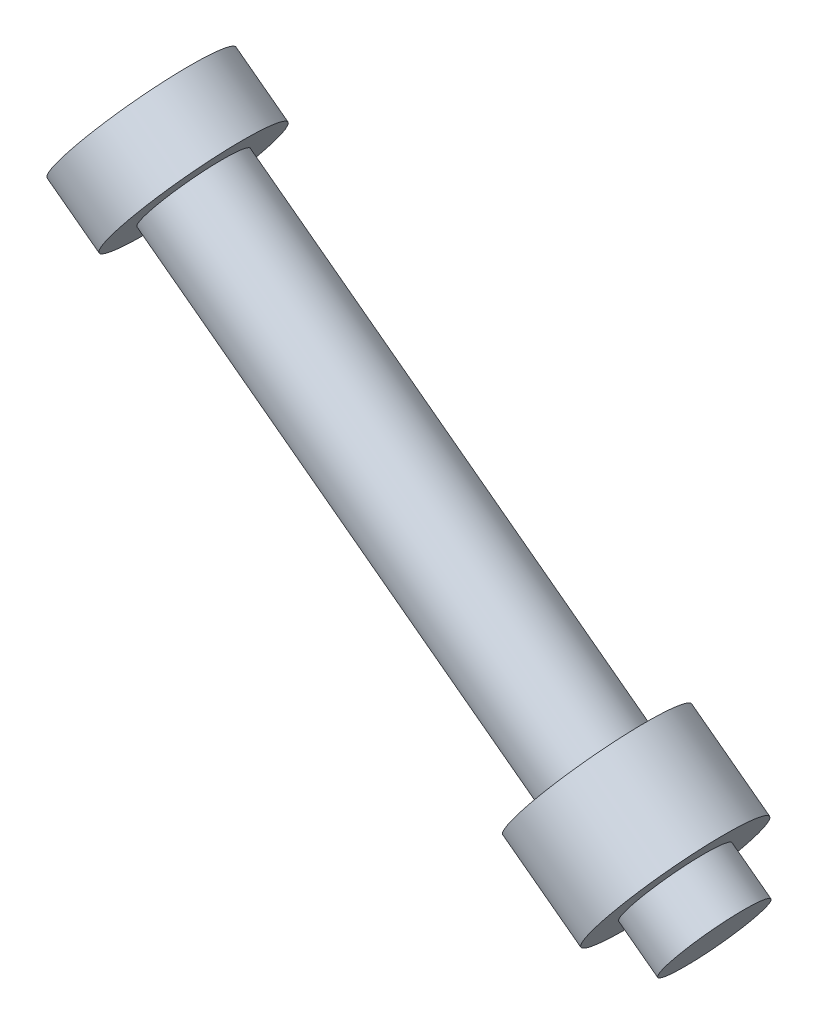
ISO-10303-21;
HEADER;
FILE_DESCRIPTION(('STEP AP214'),'2;1');
FILE_NAME('part.step','',(''),(''),'','','');
FILE_SCHEMA(('AUTOMOTIVE_DESIGN { 1 0 10303 214 1 1 1 1 }'));
ENDSEC;
DATA;
#1=APPLICATION_CONTEXT('core data for automotive mechanical design processes');
#2=APPLICATION_PROTOCOL_DEFINITION('international standard','automotive_design',2000,#1);
#3=PRODUCT_CONTEXT('',#1,'mechanical');
#4=PRODUCT('Part','Part','',(#3));
#5=PRODUCT_RELATED_PRODUCT_CATEGORY('part','',(#4));
#6=PRODUCT_DEFINITION_FORMATION('','',#4);
#7=PRODUCT_DEFINITION_CONTEXT('part definition',#1,'design');
#8=PRODUCT_DEFINITION('design','',#6,#7);
#9=PRODUCT_DEFINITION_SHAPE('','',#8);
#10=(LENGTH_UNIT() NAMED_UNIT(*) SI_UNIT(.MILLI.,.METRE.));
#11=(NAMED_UNIT(*) PLANE_ANGLE_UNIT() SI_UNIT($,.RADIAN.));
#12=(NAMED_UNIT(*) SI_UNIT($,.STERADIAN.) SOLID_ANGLE_UNIT());
#13=UNCERTAINTY_MEASURE_WITH_UNIT(LENGTH_MEASURE(1.E-05),#10,'distance_accuracy_value','');
#14=(GEOMETRIC_REPRESENTATION_CONTEXT(3) GLOBAL_UNCERTAINTY_ASSIGNED_CONTEXT((#13)) GLOBAL_UNIT_ASSIGNED_CONTEXT((#10,
#11,#12)) REPRESENTATION_CONTEXT('',''));
#15=CARTESIAN_POINT('',(0.,0.,0.));
#16=DIRECTION('',(0.,0.,1.));
#17=DIRECTION('',(1.,0.,0.));
#18=AXIS2_PLACEMENT_3D('',#15,#16,#17);
#19=CARTESIAN_POINT('',(-234.974862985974,359.135649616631,0.));
#20=DIRECTION('',(-0.800654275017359,0.599126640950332,0.));
#21=DIRECTION('',(-0.599126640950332,-0.800654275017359,0.));
#22=AXIS2_PLACEMENT_3D('',#19,#20,#21);
#23=PLANE('',#22);
#24=CARTESIAN_POINT('',(-234.974862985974,359.135649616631,0.));
#25=DIRECTION('',(-0.800654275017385,0.599126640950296,0.));
#26=DIRECTION('',(-0.599126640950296,-0.800654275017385,0.));
#27=AXIS2_PLACEMENT_3D('',#24,#25,#26);
#28=CIRCLE('',#27,3.);
#29=CARTESIAN_POINT('',(-236.772242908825,356.733686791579,0.));
#30=VERTEX_POINT('',#29);
#31=EDGE_CURVE('E71',#30,#30,#28,.T.);
#32=ORIENTED_EDGE('',*,*,#31,.T.);
#33=EDGE_LOOP('',(#32));
#34=FACE_BOUND('',#33,.T.);
#35=CARTESIAN_POINT('',(-234.974862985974,359.135649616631,0.));
#36=DIRECTION('',(-0.800654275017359,0.599126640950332,0.));
#37=DIRECTION('',(-0.599126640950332,-0.800654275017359,0.));
#38=AXIS2_PLACEMENT_3D('',#35,#36,#37);
#39=CIRCLE('',#38,5.);
#40=CARTESIAN_POINT('',(-237.970496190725,355.132378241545,0.));
#41=VERTEX_POINT('',#40);
#42=EDGE_CURVE('E66',#41,#41,#39,.T.);
#43=ORIENTED_EDGE('',*,*,#42,.F.);
#44=EDGE_LOOP('',(#43));
#45=FACE_BOUND('',#44,.T.);
#46=ADVANCED_FACE('F55',(#34,#45),#23,.F.);
#47=CARTESIAN_POINT('',(-238.177480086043,361.532156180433,0.));
#48=DIRECTION('',(-0.800654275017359,0.599126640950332,0.));
#49=DIRECTION('',(-0.599126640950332,-0.800654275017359,0.));
#50=AXIS2_PLACEMENT_3D('',#47,#48,#49);
#51=PLANE('',#50);
#52=CARTESIAN_POINT('',(-238.177480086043,361.532156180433,0.));
#53=DIRECTION('',(-0.800654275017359,0.599126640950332,0.));
#54=DIRECTION('',(-0.599126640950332,-0.800654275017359,0.));
#55=AXIS2_PLACEMENT_3D('',#52,#53,#54);
#56=CIRCLE('',#55,5.);
#57=CARTESIAN_POINT('',(-241.173113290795,357.528884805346,0.));
#58=VERTEX_POINT('',#57);
#59=EDGE_CURVE('E62',#58,#58,#56,.T.);
#60=ORIENTED_EDGE('',*,*,#59,.T.);
#61=EDGE_LOOP('',(#60));
#62=FACE_BOUND('',#61,.T.);
#63=ADVANCED_FACE('F107',(#62),#51,.T.);
#64=CARTESIAN_POINT('',(-234.974862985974,359.135649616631,0.));
#65=DIRECTION('',(-0.800654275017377,0.599126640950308,0.));
#66=DIRECTION('',(-0.599126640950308,-0.800654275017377,0.));
#67=AXIS2_PLACEMENT_3D('',#64,#65,#66);
#68=CYLINDRICAL_SURFACE('',#67,5.);
#69=ORIENTED_EDGE('',*,*,#59,.F.);
#70=EDGE_LOOP('',(#69));
#71=FACE_BOUND('',#70,.T.);
#72=ORIENTED_EDGE('',*,*,#42,.T.);
#73=EDGE_LOOP('',(#72));
#74=FACE_BOUND('',#73,.T.);
#75=ADVANCED_FACE('F98',(#71,#74),#68,.T.);
#76=CARTESIAN_POINT('',(-202.948691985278,335.17058397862,0.));
#77=DIRECTION('',(-0.800654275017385,0.599126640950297,0.));
#78=DIRECTION('',(-0.599126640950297,-0.800654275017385,0.));
#79=AXIS2_PLACEMENT_3D('',#76,#77,#78);
#80=CYLINDRICAL_SURFACE('',#79,3.);
#81=CARTESIAN_POINT('',(-210.154580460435,340.562723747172,0.));
#82=DIRECTION('',(-0.800654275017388,0.599126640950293,0.));
#83=DIRECTION('',(-0.599126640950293,-0.800654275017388,0.));
#84=AXIS2_PLACEMENT_3D('',#81,#82,#83);
#85=CIRCLE('',#84,3.);
#86=CARTESIAN_POINT('',(-211.951960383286,338.16076092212,0.));
#87=VERTEX_POINT('',#86);
#88=EDGE_CURVE('E11',#87,#87,#85,.F.);
#89=ORIENTED_EDGE('',*,*,#88,.F.);
#90=EDGE_LOOP('',(#89));
#91=FACE_BOUND('',#90,.T.);
#92=ORIENTED_EDGE('',*,*,#31,.F.);
#93=EDGE_LOOP('',(#92));
#94=FACE_BOUND('',#93,.T.);
#95=ADVANCED_FACE('F89',(#91,#94),#80,.T.);
#96=CARTESIAN_POINT('',(-205.350654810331,336.967963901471,0.));
#97=DIRECTION('',(-0.800654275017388,0.599126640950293,0.));
#98=DIRECTION('',(-0.599126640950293,-0.800654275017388,0.));
#99=AXIS2_PLACEMENT_3D('',#96,#97,#98);
#100=PLANE('',#99);
#101=CARTESIAN_POINT('',(-205.350654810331,336.96796390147,0.));
#102=DIRECTION('',(-0.800654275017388,0.599126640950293,0.));
#103=DIRECTION('',(-0.599126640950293,-0.800654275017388,0.));
#104=AXIS2_PLACEMENT_3D('',#101,#102,#103);
#105=CIRCLE('',#104,3.);
#106=CARTESIAN_POINT('',(-207.148034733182,334.566001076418,0.));
#107=VERTEX_POINT('',#106);
#108=EDGE_CURVE('E58',#107,#107,#105,.F.);
#109=ORIENTED_EDGE('',*,*,#108,.F.);
#110=EDGE_LOOP('',(#109));
#111=FACE_BOUND('',#110,.T.);
#112=CARTESIAN_POINT('',(-205.350654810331,336.967963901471,0.));
#113=DIRECTION('',(-0.800654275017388,0.599126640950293,0.));
#114=DIRECTION('',(-0.599126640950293,-0.800654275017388,0.));
#115=AXIS2_PLACEMENT_3D('',#112,#113,#114);
#116=CIRCLE('',#115,5.);
#117=CARTESIAN_POINT('',(-208.346288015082,332.964692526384,0.));
#118=VERTEX_POINT('',#117);
#119=EDGE_CURVE('E80',#118,#118,#116,.T.);
#120=ORIENTED_EDGE('',*,*,#119,.F.);
#121=EDGE_LOOP('',(#120));
#122=FACE_BOUND('',#121,.T.);
#123=ADVANCED_FACE('F86',(#111,#122),#100,.F.);
#124=CARTESIAN_POINT('',(-210.154580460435,340.562723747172,0.));
#125=DIRECTION('',(-0.800654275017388,0.599126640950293,0.));
#126=DIRECTION('',(-0.599126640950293,-0.800654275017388,0.));
#127=AXIS2_PLACEMENT_3D('',#124,#125,#126);
#128=PLANE('',#127);
#129=ORIENTED_EDGE('',*,*,#88,.T.);
#130=EDGE_LOOP('',(#129));
#131=FACE_BOUND('',#130,.T.);
#132=CARTESIAN_POINT('',(-210.154580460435,340.562723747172,0.));
#133=DIRECTION('',(-0.800654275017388,0.599126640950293,0.));
#134=DIRECTION('',(-0.599126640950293,-0.800654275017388,0.));
#135=AXIS2_PLACEMENT_3D('',#132,#133,#134);
#136=CIRCLE('',#135,5.);
#137=CARTESIAN_POINT('',(-213.150213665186,336.559452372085,0.));
#138=VERTEX_POINT('',#137);
#139=EDGE_CURVE('E77',#138,#138,#136,.T.);
#140=ORIENTED_EDGE('',*,*,#139,.T.);
#141=EDGE_LOOP('',(#140));
#142=FACE_BOUND('',#141,.T.);
#143=ADVANCED_FACE('F88',(#131,#142),#128,.T.);
#144=CARTESIAN_POINT('',(-205.350654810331,336.967963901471,0.));
#145=DIRECTION('',(-0.800654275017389,0.599126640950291,0.));
#146=DIRECTION('',(-0.599126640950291,-0.800654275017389,0.));
#147=AXIS2_PLACEMENT_3D('',#144,#145,#146);
#148=CYLINDRICAL_SURFACE('',#147,5.);
#149=ORIENTED_EDGE('',*,*,#139,.F.);
#150=EDGE_LOOP('',(#149));
#151=FACE_BOUND('',#150,.T.);
#152=ORIENTED_EDGE('',*,*,#119,.T.);
#153=EDGE_LOOP('',(#152));
#154=FACE_BOUND('',#153,.T.);
#155=ADVANCED_FACE('F84',(#151,#154),#148,.T.);
#156=CARTESIAN_POINT('',(-202.948691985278,335.17058397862,0.));
#157=DIRECTION('',(-0.800654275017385,0.599126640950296,0.));
#158=DIRECTION('',(-0.599126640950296,-0.800654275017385,0.));
#159=AXIS2_PLACEMENT_3D('',#156,#157,#158);
#160=PLANE('',#159);
#161=CARTESIAN_POINT('',(-202.948691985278,335.17058397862,0.));
#162=DIRECTION('',(-0.800654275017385,0.599126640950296,0.));
#163=DIRECTION('',(-0.599126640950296,-0.800654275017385,0.));
#164=AXIS2_PLACEMENT_3D('',#161,#162,#163);
#165=CIRCLE('',#164,3.);
#166=CARTESIAN_POINT('',(-204.746071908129,332.768621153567,0.));
#167=VERTEX_POINT('',#166);
#168=EDGE_CURVE('E74',#167,#167,#165,.T.);
#169=ORIENTED_EDGE('',*,*,#168,.F.);
#170=EDGE_LOOP('',(#169));
#171=FACE_BOUND('',#170,.T.);
#172=ADVANCED_FACE('F92',(#171),#160,.F.);
#173=ORIENTED_EDGE('',*,*,#168,.T.);
#174=EDGE_LOOP('',(#173));
#175=FACE_BOUND('',#174,.T.);
#176=ORIENTED_EDGE('',*,*,#108,.T.);
#177=EDGE_LOOP('',(#176));
#178=FACE_BOUND('',#177,.T.);
#179=ADVANCED_FACE('F101',(#175,#178),#80,.T.);
#180=CLOSED_SHELL('',(#46,#63,#75,#95,#123,#143,#155,#172,#179));
#181=MANIFOLD_SOLID_BREP('B2',#180);
#182=ADVANCED_BREP_SHAPE_REPRESENTATION('',(#18,#181),#14);
#183=SHAPE_DEFINITION_REPRESENTATION(#9,#182);
ENDSEC;
END-ISO-10303-21;
